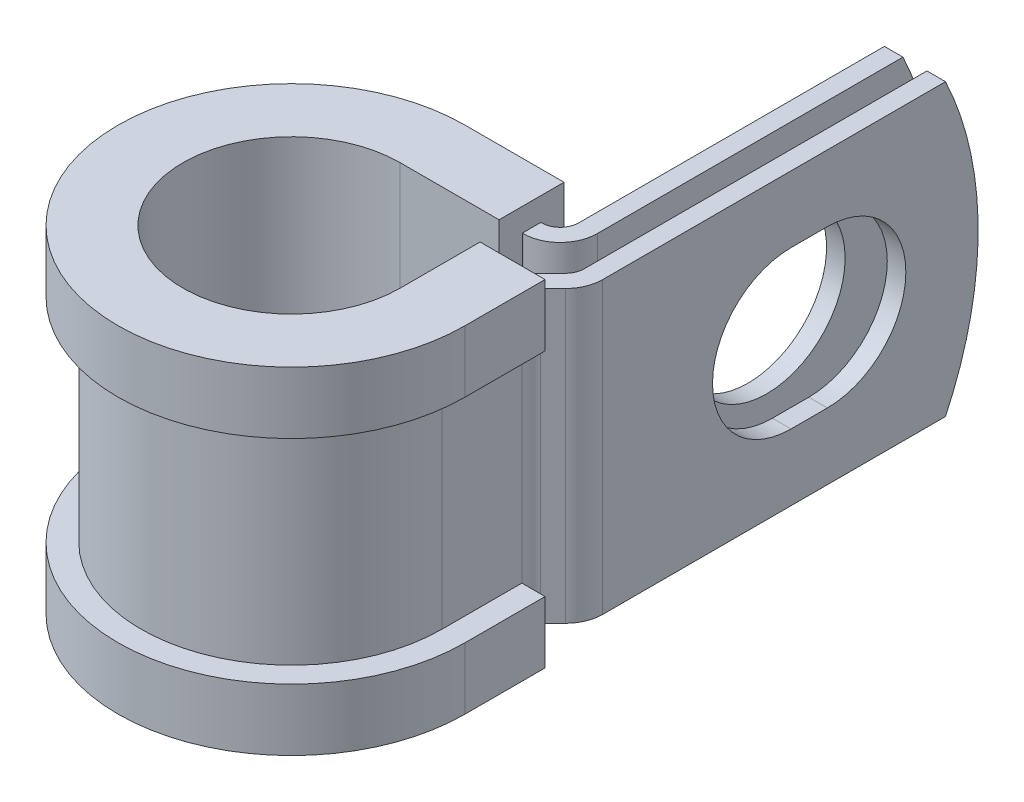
from build123d import *

# Parameters (mm, degrees)
EXTRUDE_THIN1_DEPTH = 9.525
SKETCH2_R           = 5.1562
CUT_EXTRUDE1_DEPTH  = 1.2192
CUT_EXTRUDE2_DEPTH  = 1.2192
CUT_EXTRUDE3_DEPTH  = 39.892551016


with BuildPart() as part:
    # Sketch1 → Extrude-Thin1 (new, symmetric)
    with BuildSketch(Plane(origin=(0, 0, 0), x_dir=(1, 0, 0), z_dir=(0, 1, 0))):
        with BuildLine():
            Line((10.5588698, 33.3248), (10.5588698, 8.6614))
            ThreePointArc((10.5588698, 8.6614), (10.466063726, 8.194832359), (10.201774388, 7.799295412))
            Line((10.201774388, 7.799295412), (9.375590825, 6.973111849))
            ThreePointArc((9.375590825, 6.973111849), (8.847012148, 6.182037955), (8.6614, 5.248902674))
            Line((8.6614, 5.248902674), (8.6614, 0))
            ThreePointArc((8.6614, 0), (-6.124534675, -6.124534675), (0, 8.6614))
            Line((0, 8.6614), (6.5456698, 8.6614))
            ThreePointArc((6.5456698, 8.6614), (8.269878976, 9.375590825), (8.9840698, 11.0998))
            Line((8.9840698, 11.0998), (8.9840698, 33.3248))
            Line((8.9840698, 33.3248), (7.7648698, 33.3248))
            Line((7.7648698, 33.3248), (7.7648698, 11.0998))
            ThreePointArc((7.7648698, 11.0998), (7.407774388, 10.237695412), (6.5456698, 9.8806))
            Line((6.5456698, 9.8806), (0, 9.8806))
            ThreePointArc((0, 9.8806), (-6.986639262, -6.986639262), (9.8806, 0))
            Line((9.8806, 0), (9.8806, 5.248902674))
            ThreePointArc((9.8806, 5.248902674), (9.973406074, 5.715470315), (10.237695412, 6.111007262))
            Line((10.237695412, 6.111007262), (11.063878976, 6.937190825))
            ThreePointArc((11.063878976, 6.937190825), (11.592457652, 7.728264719), (11.7780698, 8.6614))
            Line((11.7780698, 8.6614), (11.7780698, 33.3248))
            Line((11.7780698, 33.3248), (10.5588698, 33.3248))
        make_face()
    extrude(amount=EXTRUDE_THIN1_DEPTH, both=True)

    # Sketch2 → Cut-Extrude1 (cut)
    with BuildSketch(Plane.ZY.offset(-7.7648698)):
        with Locations((-22.225, 0)):
            Circle(SKETCH2_R)
    extrude(amount=-CUT_EXTRUDE1_DEPTH, mode=Mode.SUBTRACT)

    # Sketch3 → Cut-Extrude2 (cut)
    with BuildSketch(Plane(origin=(11.7780698, 0, 0), x_dir=(0, 0, -1), z_dir=(1, 0, 0))):
        with BuildLine():
            Line((21.0312, 5.1562), (23.4188, 5.1562))
            ThreePointArc((23.4188, 5.1562), (28.575, 0), (23.4188, -5.1562))
            Line((23.4188, -5.1562), (21.0312, -5.1562))
            ThreePointArc((21.0312, -5.1562), (15.875, 0), (21.0312, 5.1562))
        make_face()
    extrude(amount=-CUT_EXTRUDE2_DEPTH, mode=Mode.SUBTRACT)

    # Sketch4 → Cut-Extrude3 (cut, through all)
    with BuildSketch(Plane.ZY.offset(-7.7648698)):
        with BuildLine():
            Line((-31.180263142, 9.525), (-33.3248, 9.525))
            Line((-33.3248, 9.525), (-33.3248, -4e-08))
            ThreePointArc((-33.3248, -4e-08), (-32.782038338, 4.881717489), (-31.180263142, 9.525))
        make_face()
        with BuildLine():
            ThreePointArc((-31.180263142, -9.525), (-32.782038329, -4.881717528), (-33.3248, -4e-08))
            Line((-33.3248, -4e-08), (-33.3248, -9.525))
            Line((-33.3248, -9.525), (-31.180263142, -9.525))
        make_face()
    extrude(amount=-CUT_EXTRUDE3_DEPTH, mode=Mode.SUBTRACT)

    # Sweep1: sweep along a path in Sketch6
    with BuildLine(Plane(origin=(0, 9.525, 0), x_dir=(1, 0, 0), z_dir=(0, 1, 0))) as sweep1_path:
        Line((7.1374, 5.248902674), (7.1374, 0))
        ThreePointArc((7.1374, 0), (-5.04690394, -5.04690394), (0, 7.1374))
        Line((0, 7.1374), (6.4948698, 7.1374))
    # Sketch5 → Sweep1 (sweep)
    with BuildSketch(Plane(origin=(0, 0, -5.248902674), x_dir=(-1, 0, 0), z_dir=(0, 0, -1))):
        Polygon((-9.8806, 9.525), (-8.6614, 9.525), (-8.6614, -9.525), (-9.8806, -9.525), (-9.8806, -6.985), (-11.4046, -6.985), (-11.4046, -11.049), (-7.1374, -11.049), (-7.1374, 11.049), (-11.4046, 11.049), (-11.4046, 6.985), (-9.8806, 6.985), align=None)
    sweep(path=sweep1_path.line)


solid = part.part
